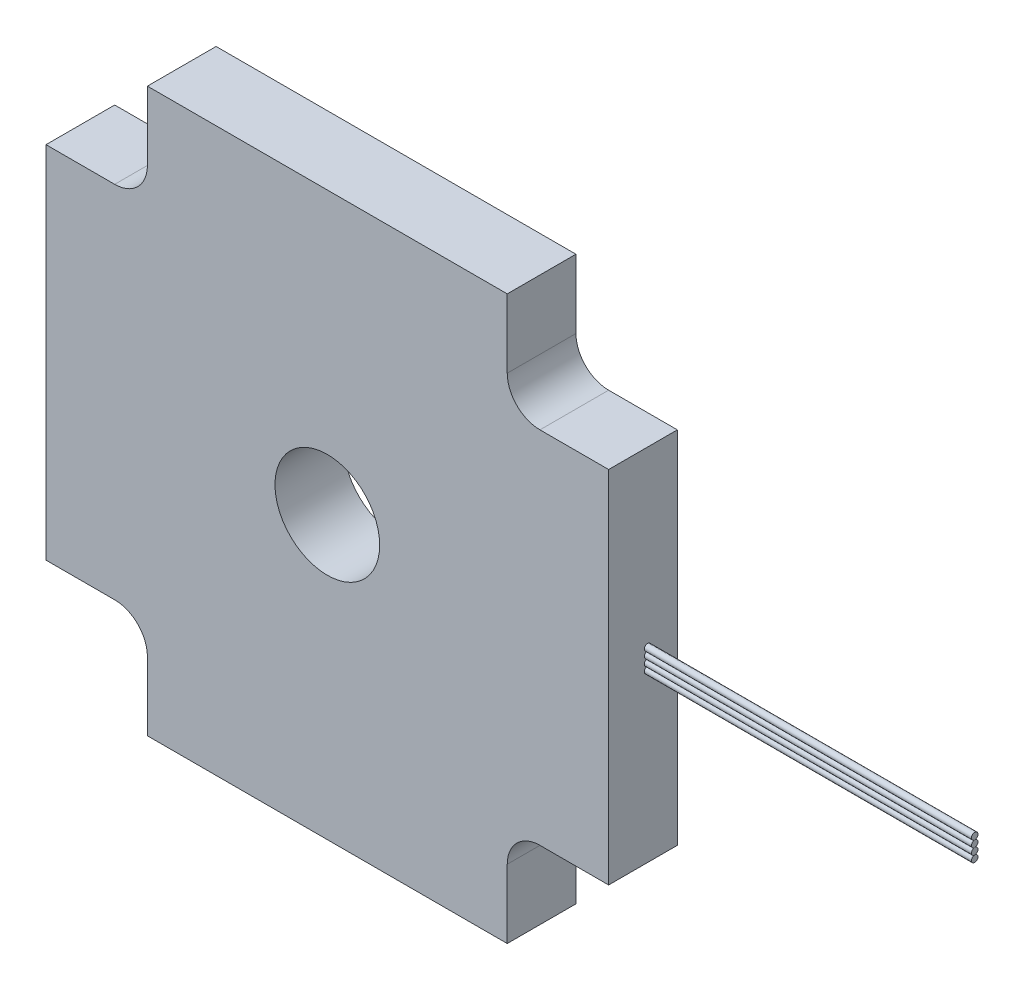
ISO-10303-21;
HEADER;
FILE_DESCRIPTION(('STEP AP214'),'2;1');
FILE_NAME('part.step','',(''),(''),'','','');
FILE_SCHEMA(('AUTOMOTIVE_DESIGN { 1 0 10303 214 1 1 1 1 }'));
ENDSEC;
DATA;
#1=APPLICATION_CONTEXT('core data for automotive mechanical design processes');
#2=APPLICATION_PROTOCOL_DEFINITION('international standard','automotive_design',2000,#1);
#3=PRODUCT_CONTEXT('',#1,'mechanical');
#4=PRODUCT('Part','Part','',(#3));
#5=PRODUCT_RELATED_PRODUCT_CATEGORY('part','',(#4));
#6=PRODUCT_DEFINITION_FORMATION('','',#4);
#7=PRODUCT_DEFINITION_CONTEXT('part definition',#1,'design');
#8=PRODUCT_DEFINITION('design','',#6,#7);
#9=PRODUCT_DEFINITION_SHAPE('','',#8);
#10=(LENGTH_UNIT() NAMED_UNIT(*) SI_UNIT(.MILLI.,.METRE.));
#11=(NAMED_UNIT(*) PLANE_ANGLE_UNIT() SI_UNIT($,.RADIAN.));
#12=(NAMED_UNIT(*) SI_UNIT($,.STERADIAN.) SOLID_ANGLE_UNIT());
#13=UNCERTAINTY_MEASURE_WITH_UNIT(LENGTH_MEASURE(1.E-05),#10,'distance_accuracy_value','');
#14=(GEOMETRIC_REPRESENTATION_CONTEXT(3) GLOBAL_UNCERTAINTY_ASSIGNED_CONTEXT((#13)) GLOBAL_UNIT_ASSIGNED_CONTEXT((#10,
#11,#12)) REPRESENTATION_CONTEXT('',''));
#15=CARTESIAN_POINT('',(0.,0.,0.));
#16=DIRECTION('',(0.,0.,1.));
#17=DIRECTION('',(1.,0.,0.));
#18=AXIS2_PLACEMENT_3D('',#15,#16,#17);
#19=CARTESIAN_POINT('',(93.,-2.,4.54479734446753));
#20=DIRECTION('',(-1.,0.,0.));
#21=DIRECTION('',(0.,0.,1.));
#22=AXIS2_PLACEMENT_3D('',#19,#20,#21);
#23=CYLINDRICAL_SURFACE('',#22,0.500000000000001);
#24=CARTESIAN_POINT('',(43.,-2.,4.54479734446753));
#25=DIRECTION('',(1.,0.,0.));
#26=DIRECTION('',(0.,0.,-1.));
#27=AXIS2_PLACEMENT_3D('',#24,#25,#26);
#28=CIRCLE('',#27,0.500000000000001);
#29=CARTESIAN_POINT('',(43.,-2.,4.04479734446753));
#30=VERTEX_POINT('',#29);
#31=EDGE_CURVE('E12',#30,#30,#28,.T.);
#32=ORIENTED_EDGE('',*,*,#31,.T.);
#33=EDGE_LOOP('',(#32));
#34=FACE_BOUND('',#33,.T.);
#35=CARTESIAN_POINT('',(93.,-2.,4.54479734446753));
#36=DIRECTION('',(1.,0.,0.));
#37=DIRECTION('',(0.,0.,-1.));
#38=AXIS2_PLACEMENT_3D('',#35,#36,#37);
#39=CIRCLE('',#38,0.500000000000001);
#40=CARTESIAN_POINT('',(93.,-2.,4.04479734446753));
#41=VERTEX_POINT('',#40);
#42=EDGE_CURVE('E56',#41,#41,#39,.T.);
#43=ORIENTED_EDGE('',*,*,#42,.F.);
#44=EDGE_LOOP('',(#43));
#45=FACE_BOUND('',#44,.T.);
#46=ADVANCED_FACE('F52',(#34,#45),#23,.T.);
#47=CARTESIAN_POINT('',(93.,-2.,4.54479734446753));
#48=DIRECTION('',(1.,0.,0.));
#49=DIRECTION('',(0.,0.,-1.));
#50=AXIS2_PLACEMENT_3D('',#47,#48,#49);
#51=PLANE('',#50);
#52=ORIENTED_EDGE('',*,*,#42,.T.);
#53=EDGE_LOOP('',(#52));
#54=FACE_BOUND('',#53,.T.);
#55=ADVANCED_FACE('F54',(#54),#51,.T.);
#56=CARTESIAN_POINT('',(43.,-2.,4.54479734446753));
#57=DIRECTION('',(1.,0.,0.));
#58=DIRECTION('',(0.,0.,-1.));
#59=AXIS2_PLACEMENT_3D('',#56,#57,#58);
#60=PLANE('',#59);
#61=ORIENTED_EDGE('',*,*,#31,.F.);
#62=EDGE_LOOP('',(#61));
#63=FACE_BOUND('',#62,.T.);
#64=ADVANCED_FACE('F71',(#63),#60,.F.);
#65=CLOSED_SHELL('',(#46,#55,#64));
#66=MANIFOLD_SOLID_BREP('B2',#65);
#67=CARTESIAN_POINT('',(93.,0.,4.54479734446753));
#68=DIRECTION('',(-1.,0.,0.));
#69=DIRECTION('',(0.,0.,1.));
#70=AXIS2_PLACEMENT_3D('',#67,#68,#69);
#71=CYLINDRICAL_SURFACE('',#70,0.500000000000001);
#72=CARTESIAN_POINT('',(43.,0.,4.54479734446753));
#73=DIRECTION('',(1.,0.,0.));
#74=DIRECTION('',(0.,0.,-1.));
#75=AXIS2_PLACEMENT_3D('',#72,#73,#74);
#76=CIRCLE('',#75,0.500000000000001);
#77=CARTESIAN_POINT('',(43.,0.,4.04479734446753));
#78=VERTEX_POINT('',#77);
#79=EDGE_CURVE('E51',#78,#78,#76,.T.);
#80=ORIENTED_EDGE('',*,*,#79,.T.);
#81=EDGE_LOOP('',(#80));
#82=FACE_BOUND('',#81,.T.);
#83=CARTESIAN_POINT('',(93.,0.,4.54479734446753));
#84=DIRECTION('',(1.,0.,0.));
#85=DIRECTION('',(0.,0.,-1.));
#86=AXIS2_PLACEMENT_3D('',#83,#84,#85);
#87=CIRCLE('',#86,0.500000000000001);
#88=CARTESIAN_POINT('',(93.,0.,4.04479734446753));
#89=VERTEX_POINT('',#88);
#90=EDGE_CURVE('E105',#89,#89,#87,.T.);
#91=ORIENTED_EDGE('',*,*,#90,.F.);
#92=EDGE_LOOP('',(#91));
#93=FACE_BOUND('',#92,.T.);
#94=ADVANCED_FACE('F101',(#82,#93),#71,.T.);
#95=CARTESIAN_POINT('',(93.,0.,4.54479734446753));
#96=DIRECTION('',(1.,0.,0.));
#97=DIRECTION('',(0.,0.,-1.));
#98=AXIS2_PLACEMENT_3D('',#95,#96,#97);
#99=PLANE('',#98);
#100=ORIENTED_EDGE('',*,*,#90,.T.);
#101=EDGE_LOOP('',(#100));
#102=FACE_BOUND('',#101,.T.);
#103=ADVANCED_FACE('F103',(#102),#99,.T.);
#104=CARTESIAN_POINT('',(43.,0.,4.54479734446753));
#105=DIRECTION('',(1.,0.,0.));
#106=DIRECTION('',(0.,0.,-1.));
#107=AXIS2_PLACEMENT_3D('',#104,#105,#106);
#108=PLANE('',#107);
#109=ORIENTED_EDGE('',*,*,#79,.F.);
#110=EDGE_LOOP('',(#109));
#111=FACE_BOUND('',#110,.T.);
#112=ADVANCED_FACE('F120',(#111),#108,.F.);
#113=CLOSED_SHELL('',(#94,#103,#112));
#114=MANIFOLD_SOLID_BREP('B7',#113);
#115=CARTESIAN_POINT('',(93.,1.,4.54479734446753));
#116=DIRECTION('',(-1.,0.,0.));
#117=DIRECTION('',(0.,0.,1.));
#118=AXIS2_PLACEMENT_3D('',#115,#116,#117);
#119=CYLINDRICAL_SURFACE('',#118,0.500000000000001);
#120=CARTESIAN_POINT('',(43.,1.,4.54479734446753));
#121=DIRECTION('',(1.,0.,0.));
#122=DIRECTION('',(0.,0.,-1.));
#123=AXIS2_PLACEMENT_3D('',#120,#121,#122);
#124=CIRCLE('',#123,0.500000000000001);
#125=CARTESIAN_POINT('',(43.,1.,4.04479734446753));
#126=VERTEX_POINT('',#125);
#127=EDGE_CURVE('E100',#126,#126,#124,.T.);
#128=ORIENTED_EDGE('',*,*,#127,.T.);
#129=EDGE_LOOP('',(#128));
#130=FACE_BOUND('',#129,.T.);
#131=CARTESIAN_POINT('',(93.,1.,4.54479734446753));
#132=DIRECTION('',(1.,0.,0.));
#133=DIRECTION('',(0.,0.,-1.));
#134=AXIS2_PLACEMENT_3D('',#131,#132,#133);
#135=CIRCLE('',#134,0.500000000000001);
#136=CARTESIAN_POINT('',(93.,1.,4.04479734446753));
#137=VERTEX_POINT('',#136);
#138=EDGE_CURVE('E154',#137,#137,#135,.T.);
#139=ORIENTED_EDGE('',*,*,#138,.F.);
#140=EDGE_LOOP('',(#139));
#141=FACE_BOUND('',#140,.T.);
#142=ADVANCED_FACE('F150',(#130,#141),#119,.T.);
#143=CARTESIAN_POINT('',(93.,1.,4.54479734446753));
#144=DIRECTION('',(1.,0.,0.));
#145=DIRECTION('',(0.,0.,-1.));
#146=AXIS2_PLACEMENT_3D('',#143,#144,#145);
#147=PLANE('',#146);
#148=ORIENTED_EDGE('',*,*,#138,.T.);
#149=EDGE_LOOP('',(#148));
#150=FACE_BOUND('',#149,.T.);
#151=ADVANCED_FACE('F152',(#150),#147,.T.);
#152=CARTESIAN_POINT('',(43.,1.,4.54479734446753));
#153=DIRECTION('',(1.,0.,0.));
#154=DIRECTION('',(0.,0.,-1.));
#155=AXIS2_PLACEMENT_3D('',#152,#153,#154);
#156=PLANE('',#155);
#157=ORIENTED_EDGE('',*,*,#127,.F.);
#158=EDGE_LOOP('',(#157));
#159=FACE_BOUND('',#158,.T.);
#160=ADVANCED_FACE('F169',(#159),#156,.F.);
#161=CLOSED_SHELL('',(#142,#151,#160));
#162=MANIFOLD_SOLID_BREP('B46',#161);
#163=CARTESIAN_POINT('',(93.,-1.,4.54479734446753));
#164=DIRECTION('',(-1.,0.,0.));
#165=DIRECTION('',(0.,0.,1.));
#166=AXIS2_PLACEMENT_3D('',#163,#164,#165);
#167=CYLINDRICAL_SURFACE('',#166,0.500000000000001);
#168=CARTESIAN_POINT('',(43.,-1.,4.54479734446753));
#169=DIRECTION('',(1.,0.,0.));
#170=DIRECTION('',(0.,0.,-1.));
#171=AXIS2_PLACEMENT_3D('',#168,#169,#170);
#172=CIRCLE('',#171,0.500000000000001);
#173=CARTESIAN_POINT('',(43.,-1.,4.04479734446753));
#174=VERTEX_POINT('',#173);
#175=EDGE_CURVE('E203',#174,#174,#172,.T.);
#176=ORIENTED_EDGE('',*,*,#175,.T.);
#177=EDGE_LOOP('',(#176));
#178=FACE_BOUND('',#177,.T.);
#179=CARTESIAN_POINT('',(93.,-1.,4.54479734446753));
#180=DIRECTION('',(1.,0.,0.));
#181=DIRECTION('',(0.,0.,-1.));
#182=AXIS2_PLACEMENT_3D('',#179,#180,#181);
#183=CIRCLE('',#182,0.500000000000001);
#184=CARTESIAN_POINT('',(93.,-1.,4.04479734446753));
#185=VERTEX_POINT('',#184);
#186=EDGE_CURVE('E149',#185,#185,#183,.T.);
#187=ORIENTED_EDGE('',*,*,#186,.F.);
#188=EDGE_LOOP('',(#187));
#189=FACE_BOUND('',#188,.T.);
#190=ADVANCED_FACE('F200',(#178,#189),#167,.T.);
#191=CARTESIAN_POINT('',(93.,-1.,4.54479734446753));
#192=DIRECTION('',(1.,0.,0.));
#193=DIRECTION('',(0.,0.,-1.));
#194=AXIS2_PLACEMENT_3D('',#191,#192,#193);
#195=PLANE('',#194);
#196=ORIENTED_EDGE('',*,*,#186,.T.);
#197=EDGE_LOOP('',(#196));
#198=FACE_BOUND('',#197,.T.);
#199=ADVANCED_FACE('F216',(#198),#195,.T.);
#200=CARTESIAN_POINT('',(43.,-1.,4.54479734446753));
#201=DIRECTION('',(1.,0.,0.));
#202=DIRECTION('',(0.,0.,-1.));
#203=AXIS2_PLACEMENT_3D('',#200,#201,#202);
#204=PLANE('',#203);
#205=ORIENTED_EDGE('',*,*,#175,.F.);
#206=EDGE_LOOP('',(#205));
#207=FACE_BOUND('',#206,.T.);
#208=ADVANCED_FACE('F214',(#207),#204,.F.);
#209=CLOSED_SHELL('',(#190,#199,#208));
#210=MANIFOLD_SOLID_BREP('B95',#209);
#211=CARTESIAN_POINT('',(32.5,-32.5,10.5));
#212=DIRECTION('',(0.,0.,1.));
#213=DIRECTION('',(1.,0.,0.));
#214=AXIS2_PLACEMENT_3D('',#211,#212,#213);
#215=CYLINDRICAL_SURFACE('',#214,5.);
#216=DIRECTION('',(0.,0.,-1.));
#217=VECTOR('',#216,1.);
#218=CARTESIAN_POINT('',(32.5,-27.5,10.5));
#219=LINE('',#218,#217);
#220=CARTESIAN_POINT('',(32.5,-27.5,10.5));
#221=VERTEX_POINT('',#220);
#222=CARTESIAN_POINT('',(32.5,-27.5,0.));
#223=VERTEX_POINT('',#222);
#224=EDGE_CURVE('E404',#221,#223,#219,.T.);
#225=ORIENTED_EDGE('',*,*,#224,.F.);
#226=CARTESIAN_POINT('',(32.5,-32.5,10.5));
#227=DIRECTION('',(0.,0.,1.));
#228=DIRECTION('',(1.,0.,0.));
#229=AXIS2_PLACEMENT_3D('',#226,#227,#228);
#230=CIRCLE('',#229,5.);
#231=CARTESIAN_POINT('',(27.5,-32.5,10.5));
#232=VERTEX_POINT('',#231);
#233=EDGE_CURVE('E410',#221,#232,#230,.T.);
#234=ORIENTED_EDGE('',*,*,#233,.T.);
#235=DIRECTION('',(0.,0.,-1.));
#236=VECTOR('',#235,1.);
#237=CARTESIAN_POINT('',(27.5,-32.5,10.5));
#238=LINE('',#237,#236);
#239=CARTESIAN_POINT('',(27.5,-32.5,0.));
#240=VERTEX_POINT('',#239);
#241=EDGE_CURVE('E407',#240,#232,#238,.F.);
#242=ORIENTED_EDGE('',*,*,#241,.F.);
#243=CARTESIAN_POINT('',(32.5,-32.5,0.));
#244=DIRECTION('',(0.,0.,1.));
#245=DIRECTION('',(1.,0.,0.));
#246=AXIS2_PLACEMENT_3D('',#243,#244,#245);
#247=CIRCLE('',#246,5.);
#248=EDGE_CURVE('E412',#240,#223,#247,.F.);
#249=ORIENTED_EDGE('',*,*,#248,.T.);
#250=EDGE_LOOP('',(#225,#234,#242,#249));
#251=FACE_BOUND('',#250,.T.);
#252=ADVANCED_FACE('F241',(#251),#215,.F.);
#253=CARTESIAN_POINT('',(32.5,32.5,10.5));
#254=DIRECTION('',(0.,0.,1.));
#255=DIRECTION('',(1.,0.,0.));
#256=AXIS2_PLACEMENT_3D('',#253,#254,#255);
#257=CYLINDRICAL_SURFACE('',#256,5.);
#258=DIRECTION('',(0.,0.,-1.));
#259=VECTOR('',#258,1.);
#260=CARTESIAN_POINT('',(27.5,32.5,10.5));
#261=LINE('',#260,#259);
#262=CARTESIAN_POINT('',(27.5,32.5,10.5));
#263=VERTEX_POINT('',#262);
#264=CARTESIAN_POINT('',(27.5,32.5,0.));
#265=VERTEX_POINT('',#264);
#266=EDGE_CURVE('E394',#263,#265,#261,.T.);
#267=ORIENTED_EDGE('',*,*,#266,.F.);
#268=CARTESIAN_POINT('',(32.5,32.5,10.5));
#269=DIRECTION('',(0.,0.,1.));
#270=DIRECTION('',(1.,0.,0.));
#271=AXIS2_PLACEMENT_3D('',#268,#269,#270);
#272=CIRCLE('',#271,5.);
#273=CARTESIAN_POINT('',(32.5,27.5,10.5));
#274=VERTEX_POINT('',#273);
#275=EDGE_CURVE('E400',#263,#274,#272,.T.);
#276=ORIENTED_EDGE('',*,*,#275,.T.);
#277=DIRECTION('',(0.,0.,-1.));
#278=VECTOR('',#277,1.);
#279=CARTESIAN_POINT('',(32.5,27.5,10.5));
#280=LINE('',#279,#278);
#281=CARTESIAN_POINT('',(32.5,27.5,0.));
#282=VERTEX_POINT('',#281);
#283=EDGE_CURVE('E397',#282,#274,#280,.F.);
#284=ORIENTED_EDGE('',*,*,#283,.F.);
#285=CARTESIAN_POINT('',(32.5,32.5,0.));
#286=DIRECTION('',(0.,0.,1.));
#287=DIRECTION('',(1.,0.,0.));
#288=AXIS2_PLACEMENT_3D('',#285,#286,#287);
#289=CIRCLE('',#288,5.);
#290=EDGE_CURVE('E402',#282,#265,#289,.F.);
#291=ORIENTED_EDGE('',*,*,#290,.T.);
#292=EDGE_LOOP('',(#267,#276,#284,#291));
#293=FACE_BOUND('',#292,.T.);
#294=ADVANCED_FACE('F509',(#293),#257,.F.);
#295=CARTESIAN_POINT('',(-32.5,32.5,10.5));
#296=DIRECTION('',(0.,0.,-1.));
#297=DIRECTION('',(-1.,0.,0.));
#298=AXIS2_PLACEMENT_3D('',#295,#296,#297);
#299=CYLINDRICAL_SURFACE('',#298,5.);
#300=DIRECTION('',(0.,0.,1.));
#301=VECTOR('',#300,1.);
#302=CARTESIAN_POINT('',(-27.5,32.5,10.5));
#303=LINE('',#302,#301);
#304=CARTESIAN_POINT('',(-27.5,32.5,0.));
#305=VERTEX_POINT('',#304);
#306=CARTESIAN_POINT('',(-27.5,32.5,10.5));
#307=VERTEX_POINT('',#306);
#308=EDGE_CURVE('E379',#305,#307,#303,.T.);
#309=ORIENTED_EDGE('',*,*,#308,.F.);
#310=CARTESIAN_POINT('',(-32.5,32.5,0.));
#311=DIRECTION('',(0.,0.,1.));
#312=DIRECTION('',(1.,0.,0.));
#313=AXIS2_PLACEMENT_3D('',#310,#311,#312);
#314=CIRCLE('',#313,5.);
#315=CARTESIAN_POINT('',(-32.5,27.5,0.));
#316=VERTEX_POINT('',#315);
#317=EDGE_CURVE('E390',#305,#316,#314,.F.);
#318=ORIENTED_EDGE('',*,*,#317,.T.);
#319=DIRECTION('',(0.,0.,1.));
#320=VECTOR('',#319,1.);
#321=CARTESIAN_POINT('',(-32.5,27.5,10.5));
#322=LINE('',#321,#320);
#323=CARTESIAN_POINT('',(-32.5,27.5,10.5));
#324=VERTEX_POINT('',#323);
#325=EDGE_CURVE('E382',#324,#316,#322,.F.);
#326=ORIENTED_EDGE('',*,*,#325,.F.);
#327=CARTESIAN_POINT('',(-32.5,32.5,10.5));
#328=DIRECTION('',(0.,0.,1.));
#329=DIRECTION('',(1.,0.,0.));
#330=AXIS2_PLACEMENT_3D('',#327,#328,#329);
#331=CIRCLE('',#330,5.);
#332=EDGE_CURVE('E392',#324,#307,#331,.T.);
#333=ORIENTED_EDGE('',*,*,#332,.T.);
#334=EDGE_LOOP('',(#309,#318,#326,#333));
#335=FACE_BOUND('',#334,.T.);
#336=ADVANCED_FACE('F514',(#335),#299,.F.);
#337=CARTESIAN_POINT('',(-27.5,-43.,10.5));
#338=DIRECTION('',(1.,0.,0.));
#339=DIRECTION('',(0.,1.,0.));
#340=AXIS2_PLACEMENT_3D('',#337,#338,#339);
#341=PLANE('',#340);
#342=DIRECTION('',(0.,-1.,0.));
#343=VECTOR('',#342,1.);
#344=CARTESIAN_POINT('',(-27.5,-43.,10.5));
#345=LINE('',#344,#343);
#346=CARTESIAN_POINT('',(-27.5,-32.5,10.5));
#347=VERTEX_POINT('',#346);
#348=CARTESIAN_POINT('',(-27.5,-43.,10.5));
#349=VERTEX_POINT('',#348);
#350=EDGE_CURVE('E353',#347,#349,#345,.T.);
#351=ORIENTED_EDGE('',*,*,#350,.F.);
#352=DIRECTION('',(0.,0.,-1.));
#353=VECTOR('',#352,1.);
#354=CARTESIAN_POINT('',(-27.5,-32.5,0.));
#355=LINE('',#354,#353);
#356=CARTESIAN_POINT('',(-27.5,-32.5,0.));
#357=VERTEX_POINT('',#356);
#358=EDGE_CURVE('E414',#347,#357,#355,.T.);
#359=ORIENTED_EDGE('',*,*,#358,.T.);
#360=DIRECTION('',(0.,-1.,0.));
#361=VECTOR('',#360,1.);
#362=CARTESIAN_POINT('',(-27.5,-43.,0.));
#363=LINE('',#362,#361);
#364=CARTESIAN_POINT('',(-27.5,-43.,0.));
#365=VERTEX_POINT('',#364);
#366=EDGE_CURVE('E377',#357,#365,#363,.T.);
#367=ORIENTED_EDGE('',*,*,#366,.T.);
#368=DIRECTION('',(0.,0.,-1.));
#369=VECTOR('',#368,1.);
#370=CARTESIAN_POINT('',(-27.5,-43.,10.5));
#371=LINE('',#370,#369);
#372=EDGE_CURVE('E370',#349,#365,#371,.T.);
#373=ORIENTED_EDGE('',*,*,#372,.F.);
#374=EDGE_LOOP('',(#351,#359,#367,#373));
#375=FACE_BOUND('',#374,.T.);
#376=ADVANCED_FACE('F376',(#375),#341,.F.);
#377=CARTESIAN_POINT('',(27.5,-43.,10.5));
#378=DIRECTION('',(0.,1.,0.));
#379=DIRECTION('',(0.,0.,1.));
#380=AXIS2_PLACEMENT_3D('',#377,#378,#379);
#381=PLANE('',#380);
#382=DIRECTION('',(1.,0.,0.));
#383=VECTOR('',#382,1.);
#384=CARTESIAN_POINT('',(27.5,-43.,0.));
#385=LINE('',#384,#383);
#386=CARTESIAN_POINT('',(27.5,-43.,0.));
#387=VERTEX_POINT('',#386);
#388=EDGE_CURVE('E419',#365,#387,#385,.T.);
#389=ORIENTED_EDGE('',*,*,#388,.T.);
#390=DIRECTION('',(0.,0.,-1.));
#391=VECTOR('',#390,1.);
#392=CARTESIAN_POINT('',(27.5,-43.,10.5));
#393=LINE('',#392,#391);
#394=CARTESIAN_POINT('',(27.5,-43.,10.5));
#395=VERTEX_POINT('',#394);
#396=EDGE_CURVE('E372',#395,#387,#393,.T.);
#397=ORIENTED_EDGE('',*,*,#396,.F.);
#398=DIRECTION('',(1.,0.,0.));
#399=VECTOR('',#398,1.);
#400=CARTESIAN_POINT('',(27.5,-43.,10.5));
#401=LINE('',#400,#399);
#402=EDGE_CURVE('E358',#349,#395,#401,.T.);
#403=ORIENTED_EDGE('',*,*,#402,.F.);
#404=ORIENTED_EDGE('',*,*,#372,.T.);
#405=EDGE_LOOP('',(#389,#397,#403,#404));
#406=FACE_BOUND('',#405,.T.);
#407=ADVANCED_FACE('F369',(#406),#381,.F.);
#408=CARTESIAN_POINT('',(27.5,-43.,10.5));
#409=DIRECTION('',(-1.,0.,0.));
#410=DIRECTION('',(0.,0.,1.));
#411=AXIS2_PLACEMENT_3D('',#408,#409,#410);
#412=PLANE('',#411);
#413=DIRECTION('',(0.,1.,0.));
#414=VECTOR('',#413,1.);
#415=CARTESIAN_POINT('',(27.5,-43.,0.));
#416=LINE('',#415,#414);
#417=EDGE_CURVE('E422',#387,#240,#416,.T.);
#418=ORIENTED_EDGE('',*,*,#417,.T.);
#419=ORIENTED_EDGE('',*,*,#241,.T.);
#420=DIRECTION('',(0.,1.,0.));
#421=VECTOR('',#420,1.);
#422=CARTESIAN_POINT('',(27.5,-43.,10.5));
#423=LINE('',#422,#421);
#424=EDGE_CURVE('E374',#395,#232,#423,.T.);
#425=ORIENTED_EDGE('',*,*,#424,.F.);
#426=ORIENTED_EDGE('',*,*,#396,.T.);
#427=EDGE_LOOP('',(#418,#419,#425,#426));
#428=FACE_BOUND('',#427,.T.);
#429=ADVANCED_FACE('F526',(#428),#412,.F.);
#430=CARTESIAN_POINT('',(43.,-27.5,10.5));
#431=DIRECTION('',(0.,1.,0.));
#432=DIRECTION('',(0.,0.,1.));
#433=AXIS2_PLACEMENT_3D('',#430,#431,#432);
#434=PLANE('',#433);
#435=DIRECTION('',(1.,0.,0.));
#436=VECTOR('',#435,1.);
#437=CARTESIAN_POINT('',(43.,-27.5,10.5));
#438=LINE('',#437,#436);
#439=CARTESIAN_POINT('',(43.,-27.5,10.5));
#440=VERTEX_POINT('',#439);
#441=EDGE_CURVE('E489',#221,#440,#438,.T.);
#442=ORIENTED_EDGE('',*,*,#441,.F.);
#443=ORIENTED_EDGE('',*,*,#224,.T.);
#444=DIRECTION('',(1.,0.,0.));
#445=VECTOR('',#444,1.);
#446=CARTESIAN_POINT('',(43.,-27.5,0.));
#447=LINE('',#446,#445);
#448=CARTESIAN_POINT('',(43.,-27.5,0.));
#449=VERTEX_POINT('',#448);
#450=EDGE_CURVE('E433',#223,#449,#447,.T.);
#451=ORIENTED_EDGE('',*,*,#450,.T.);
#452=DIRECTION('',(0.,0.,-1.));
#453=VECTOR('',#452,1.);
#454=CARTESIAN_POINT('',(43.,-27.5,10.5));
#455=LINE('',#454,#453);
#456=EDGE_CURVE('E384',#440,#449,#455,.T.);
#457=ORIENTED_EDGE('',*,*,#456,.F.);
#458=EDGE_LOOP('',(#442,#443,#451,#457));
#459=FACE_BOUND('',#458,.T.);
#460=ADVANCED_FACE('F529',(#459),#434,.F.);
#461=CARTESIAN_POINT('',(43.,-27.5,10.5));
#462=DIRECTION('',(-1.,0.,0.));
#463=DIRECTION('',(0.,0.,1.));
#464=AXIS2_PLACEMENT_3D('',#461,#462,#463);
#465=PLANE('',#464);
#466=DIRECTION('',(0.,1.,0.));
#467=VECTOR('',#466,1.);
#468=CARTESIAN_POINT('',(43.,-27.5,0.));
#469=LINE('',#468,#467);
#470=CARTESIAN_POINT('',(43.,27.5,0.));
#471=VERTEX_POINT('',#470);
#472=EDGE_CURVE('E435',#449,#471,#469,.T.);
#473=ORIENTED_EDGE('',*,*,#472,.T.);
#474=DIRECTION('',(0.,0.,-1.));
#475=VECTOR('',#474,1.);
#476=CARTESIAN_POINT('',(43.,27.5,10.5));
#477=LINE('',#476,#475);
#478=CARTESIAN_POINT('',(43.,27.5,10.5));
#479=VERTEX_POINT('',#478);
#480=EDGE_CURVE('E464',#479,#471,#477,.T.);
#481=ORIENTED_EDGE('',*,*,#480,.F.);
#482=DIRECTION('',(0.,1.,0.));
#483=VECTOR('',#482,1.);
#484=CARTESIAN_POINT('',(43.,-27.5,10.5));
#485=LINE('',#484,#483);
#486=EDGE_CURVE('E473',#440,#479,#485,.T.);
#487=ORIENTED_EDGE('',*,*,#486,.F.);
#488=ORIENTED_EDGE('',*,*,#456,.T.);
#489=EDGE_LOOP('',(#473,#481,#487,#488));
#490=FACE_BOUND('',#489,.T.);
#491=ADVANCED_FACE('F471',(#490),#465,.F.);
#492=CARTESIAN_POINT('',(43.,27.5,10.5));
#493=DIRECTION('',(0.,-1.,0.));
#494=DIRECTION('',(0.,0.,-1.));
#495=AXIS2_PLACEMENT_3D('',#492,#493,#494);
#496=PLANE('',#495);
#497=DIRECTION('',(-1.,0.,0.));
#498=VECTOR('',#497,1.);
#499=CARTESIAN_POINT('',(43.,27.5,0.));
#500=LINE('',#499,#498);
#501=EDGE_CURVE('E437',#471,#282,#500,.T.);
#502=ORIENTED_EDGE('',*,*,#501,.T.);
#503=ORIENTED_EDGE('',*,*,#283,.T.);
#504=DIRECTION('',(-1.,0.,0.));
#505=VECTOR('',#504,1.);
#506=CARTESIAN_POINT('',(43.,27.5,10.5));
#507=LINE('',#506,#505);
#508=EDGE_CURVE('E484',#479,#274,#507,.T.);
#509=ORIENTED_EDGE('',*,*,#508,.F.);
#510=ORIENTED_EDGE('',*,*,#480,.T.);
#511=EDGE_LOOP('',(#502,#503,#509,#510));
#512=FACE_BOUND('',#511,.T.);
#513=ADVANCED_FACE('F481',(#512),#496,.F.);
#514=CARTESIAN_POINT('',(27.5,27.5,10.5));
#515=DIRECTION('',(-1.,0.,0.));
#516=DIRECTION('',(0.,0.,1.));
#517=AXIS2_PLACEMENT_3D('',#514,#515,#516);
#518=PLANE('',#517);
#519=DIRECTION('',(0.,1.,0.));
#520=VECTOR('',#519,1.);
#521=CARTESIAN_POINT('',(27.5,27.5,10.5));
#522=LINE('',#521,#520);
#523=CARTESIAN_POINT('',(27.5,43.,10.5));
#524=VERTEX_POINT('',#523);
#525=EDGE_CURVE('E485',#263,#524,#522,.T.);
#526=ORIENTED_EDGE('',*,*,#525,.F.);
#527=ORIENTED_EDGE('',*,*,#266,.T.);
#528=DIRECTION('',(0.,1.,0.));
#529=VECTOR('',#528,1.);
#530=CARTESIAN_POINT('',(27.5,27.5,0.));
#531=LINE('',#530,#529);
#532=CARTESIAN_POINT('',(27.5,43.,0.));
#533=VERTEX_POINT('',#532);
#534=EDGE_CURVE('E440',#265,#533,#531,.T.);
#535=ORIENTED_EDGE('',*,*,#534,.T.);
#536=DIRECTION('',(0.,0.,-1.));
#537=VECTOR('',#536,1.);
#538=CARTESIAN_POINT('',(27.5,43.,10.5));
#539=LINE('',#538,#537);
#540=EDGE_CURVE('E461',#524,#533,#539,.T.);
#541=ORIENTED_EDGE('',*,*,#540,.F.);
#542=EDGE_LOOP('',(#526,#527,#535,#541));
#543=FACE_BOUND('',#542,.T.);
#544=ADVANCED_FACE('F537',(#543),#518,.F.);
#545=CARTESIAN_POINT('',(27.5,43.,10.5));
#546=DIRECTION('',(0.,-1.,0.));
#547=DIRECTION('',(0.,0.,-1.));
#548=AXIS2_PLACEMENT_3D('',#545,#546,#547);
#549=PLANE('',#548);
#550=DIRECTION('',(-1.,0.,0.));
#551=VECTOR('',#550,1.);
#552=CARTESIAN_POINT('',(27.5,43.,0.));
#553=LINE('',#552,#551);
#554=CARTESIAN_POINT('',(-27.5,43.,0.));
#555=VERTEX_POINT('',#554);
#556=EDGE_CURVE('E442',#533,#555,#553,.T.);
#557=ORIENTED_EDGE('',*,*,#556,.T.);
#558=DIRECTION('',(0.,0.,-1.));
#559=VECTOR('',#558,1.);
#560=CARTESIAN_POINT('',(-27.5,43.,10.5));
#561=LINE('',#560,#559);
#562=CARTESIAN_POINT('',(-27.5,43.,10.5));
#563=VERTEX_POINT('',#562);
#564=EDGE_CURVE('E458',#563,#555,#561,.T.);
#565=ORIENTED_EDGE('',*,*,#564,.F.);
#566=DIRECTION('',(-1.,0.,0.));
#567=VECTOR('',#566,1.);
#568=CARTESIAN_POINT('',(27.5,43.,10.5));
#569=LINE('',#568,#567);
#570=EDGE_CURVE('E487',#524,#563,#569,.T.);
#571=ORIENTED_EDGE('',*,*,#570,.F.);
#572=ORIENTED_EDGE('',*,*,#540,.T.);
#573=EDGE_LOOP('',(#557,#565,#571,#572));
#574=FACE_BOUND('',#573,.T.);
#575=ADVANCED_FACE('F540',(#574),#549,.F.);
#576=CARTESIAN_POINT('',(-27.5,27.5,10.5));
#577=DIRECTION('',(1.,0.,0.));
#578=DIRECTION('',(0.,1.,0.));
#579=AXIS2_PLACEMENT_3D('',#576,#577,#578);
#580=PLANE('',#579);
#581=DIRECTION('',(0.,-1.,0.));
#582=VECTOR('',#581,1.);
#583=CARTESIAN_POINT('',(-27.5,27.5,0.));
#584=LINE('',#583,#582);
#585=EDGE_CURVE('E444',#555,#305,#584,.T.);
#586=ORIENTED_EDGE('',*,*,#585,.T.);
#587=ORIENTED_EDGE('',*,*,#308,.T.);
#588=DIRECTION('',(0.,-1.,0.));
#589=VECTOR('',#588,1.);
#590=CARTESIAN_POINT('',(-27.5,27.5,10.5));
#591=LINE('',#590,#589);
#592=EDGE_CURVE('E494',#563,#307,#591,.T.);
#593=ORIENTED_EDGE('',*,*,#592,.F.);
#594=ORIENTED_EDGE('',*,*,#564,.T.);
#595=EDGE_LOOP('',(#586,#587,#593,#594));
#596=FACE_BOUND('',#595,.T.);
#597=ADVANCED_FACE('F544',(#596),#580,.F.);
#598=CARTESIAN_POINT('',(-27.5,27.5,10.5));
#599=DIRECTION('',(0.,-1.,0.));
#600=DIRECTION('',(1.,0.,0.));
#601=AXIS2_PLACEMENT_3D('',#598,#599,#600);
#602=PLANE('',#601);
#603=DIRECTION('',(-1.,0.,0.));
#604=VECTOR('',#603,1.);
#605=CARTESIAN_POINT('',(-27.5,27.5,10.5));
#606=LINE('',#605,#604);
#607=CARTESIAN_POINT('',(-43.,27.5,10.5));
#608=VERTEX_POINT('',#607);
#609=EDGE_CURVE('E497',#324,#608,#606,.T.);
#610=ORIENTED_EDGE('',*,*,#609,.F.);
#611=ORIENTED_EDGE('',*,*,#325,.T.);
#612=DIRECTION('',(-1.,0.,0.));
#613=VECTOR('',#612,1.);
#614=CARTESIAN_POINT('',(-27.5,27.5,0.));
#615=LINE('',#614,#613);
#616=CARTESIAN_POINT('',(-43.,27.5,0.));
#617=VERTEX_POINT('',#616);
#618=EDGE_CURVE('E447',#316,#617,#615,.T.);
#619=ORIENTED_EDGE('',*,*,#618,.T.);
#620=DIRECTION('',(0.,0.,-1.));
#621=VECTOR('',#620,1.);
#622=CARTESIAN_POINT('',(-43.,27.5,10.5));
#623=LINE('',#622,#621);
#624=EDGE_CURVE('E455',#608,#617,#623,.T.);
#625=ORIENTED_EDGE('',*,*,#624,.F.);
#626=EDGE_LOOP('',(#610,#611,#619,#625));
#627=FACE_BOUND('',#626,.T.);
#628=ADVANCED_FACE('F548',(#627),#602,.F.);
#629=CARTESIAN_POINT('',(-43.,-27.5,10.5));
#630=DIRECTION('',(1.,0.,0.));
#631=DIRECTION('',(0.,0.,-1.));
#632=AXIS2_PLACEMENT_3D('',#629,#630,#631);
#633=PLANE('',#632);
#634=DIRECTION('',(0.,-1.,0.));
#635=VECTOR('',#634,1.);
#636=CARTESIAN_POINT('',(-43.,-27.5,0.));
#637=LINE('',#636,#635);
#638=CARTESIAN_POINT('',(-43.,-27.5,0.));
#639=VERTEX_POINT('',#638);
#640=EDGE_CURVE('E449',#617,#639,#637,.T.);
#641=ORIENTED_EDGE('',*,*,#640,.T.);
#642=DIRECTION('',(0.,0.,-1.));
#643=VECTOR('',#642,1.);
#644=CARTESIAN_POINT('',(-43.,-27.5,10.5));
#645=LINE('',#644,#643);
#646=CARTESIAN_POINT('',(-43.,-27.5,10.5));
#647=VERTEX_POINT('',#646);
#648=EDGE_CURVE('E452',#647,#639,#645,.T.);
#649=ORIENTED_EDGE('',*,*,#648,.F.);
#650=DIRECTION('',(0.,-1.,0.));
#651=VECTOR('',#650,1.);
#652=CARTESIAN_POINT('',(-43.,-27.5,10.5));
#653=LINE('',#652,#651);
#654=EDGE_CURVE('E498',#608,#647,#653,.T.);
#655=ORIENTED_EDGE('',*,*,#654,.F.);
#656=ORIENTED_EDGE('',*,*,#624,.T.);
#657=EDGE_LOOP('',(#641,#649,#655,#656));
#658=FACE_BOUND('',#657,.T.);
#659=ADVANCED_FACE('F552',(#658),#633,.F.);
#660=CARTESIAN_POINT('',(-27.5,-27.5,10.5));
#661=DIRECTION('',(0.,1.,0.));
#662=DIRECTION('',(0.,0.,1.));
#663=AXIS2_PLACEMENT_3D('',#660,#661,#662);
#664=PLANE('',#663);
#665=DIRECTION('',(1.,0.,0.));
#666=VECTOR('',#665,1.);
#667=CARTESIAN_POINT('',(-27.5,-27.5,0.));
#668=LINE('',#667,#666);
#669=CARTESIAN_POINT('',(-32.5,-27.5,0.));
#670=VERTEX_POINT('',#669);
#671=EDGE_CURVE('E365',#639,#670,#668,.T.);
#672=ORIENTED_EDGE('',*,*,#671,.T.);
#673=DIRECTION('',(0.,0.,-1.));
#674=VECTOR('',#673,1.);
#675=CARTESIAN_POINT('',(-32.5,-27.5,10.5));
#676=LINE('',#675,#674);
#677=CARTESIAN_POINT('',(-32.5,-27.5,10.5));
#678=VERTEX_POINT('',#677);
#679=EDGE_CURVE('E256',#670,#678,#676,.F.);
#680=ORIENTED_EDGE('',*,*,#679,.T.);
#681=DIRECTION('',(1.,0.,0.));
#682=VECTOR('',#681,1.);
#683=CARTESIAN_POINT('',(-27.5,-27.5,10.5));
#684=LINE('',#683,#682);
#685=EDGE_CURVE('E428',#647,#678,#684,.T.);
#686=ORIENTED_EDGE('',*,*,#685,.F.);
#687=ORIENTED_EDGE('',*,*,#648,.T.);
#688=EDGE_LOOP('',(#672,#680,#686,#687));
#689=FACE_BOUND('',#688,.T.);
#690=ADVANCED_FACE('F556',(#689),#664,.F.);
#691=CARTESIAN_POINT('',(0.,0.,10.5));
#692=DIRECTION('',(0.,0.,1.));
#693=DIRECTION('',(1.,0.,0.));
#694=AXIS2_PLACEMENT_3D('',#691,#692,#693);
#695=PLANE('',#694);
#696=ORIENTED_EDGE('',*,*,#233,.F.);
#697=ORIENTED_EDGE('',*,*,#441,.T.);
#698=ORIENTED_EDGE('',*,*,#486,.T.);
#699=ORIENTED_EDGE('',*,*,#508,.T.);
#700=ORIENTED_EDGE('',*,*,#275,.F.);
#701=ORIENTED_EDGE('',*,*,#525,.T.);
#702=ORIENTED_EDGE('',*,*,#570,.T.);
#703=ORIENTED_EDGE('',*,*,#592,.T.);
#704=ORIENTED_EDGE('',*,*,#332,.F.);
#705=ORIENTED_EDGE('',*,*,#609,.T.);
#706=ORIENTED_EDGE('',*,*,#654,.T.);
#707=ORIENTED_EDGE('',*,*,#685,.T.);
#708=CARTESIAN_POINT('',(-32.5,-32.5,10.5));
#709=DIRECTION('',(0.,0.,1.));
#710=DIRECTION('',(1.,0.,0.));
#711=AXIS2_PLACEMENT_3D('',#708,#709,#710);
#712=CIRCLE('',#711,5.);
#713=EDGE_CURVE('E198',#678,#347,#712,.F.);
#714=ORIENTED_EDGE('',*,*,#713,.T.);
#715=ORIENTED_EDGE('',*,*,#350,.T.);
#716=ORIENTED_EDGE('',*,*,#402,.T.);
#717=ORIENTED_EDGE('',*,*,#424,.T.);
#718=EDGE_LOOP('',(#696,#697,#698,#699,#700,#701,#702,#703,#704,#705,#706,#707,#714,#715,#716,#717));
#719=FACE_BOUND('',#718,.T.);
#720=CARTESIAN_POINT('',(0.,0.,10.5));
#721=DIRECTION('',(0.,0.,1.));
#722=DIRECTION('',(1.,0.,0.));
#723=AXIS2_PLACEMENT_3D('',#720,#721,#722);
#724=CIRCLE('',#723,8.);
#725=CARTESIAN_POINT('',(8.,0.,10.5));
#726=VERTEX_POINT('',#725);
#727=EDGE_CURVE('E425',#726,#726,#724,.T.);
#728=ORIENTED_EDGE('',*,*,#727,.F.);
#729=EDGE_LOOP('',(#728));
#730=FACE_BOUND('',#729,.T.);
#731=ADVANCED_FACE('F355',(#719,#730),#695,.T.);
#732=CARTESIAN_POINT('',(0.,0.,0.));
#733=DIRECTION('',(0.,0.,1.));
#734=DIRECTION('',(1.,0.,0.));
#735=AXIS2_PLACEMENT_3D('',#732,#733,#734);
#736=PLANE('',#735);
#737=CARTESIAN_POINT('',(0.,0.,0.));
#738=DIRECTION('',(0.,0.,1.));
#739=DIRECTION('',(1.,0.,0.));
#740=AXIS2_PLACEMENT_3D('',#737,#738,#739);
#741=CIRCLE('',#740,8.);
#742=CARTESIAN_POINT('',(8.,0.,0.));
#743=VERTEX_POINT('',#742);
#744=EDGE_CURVE('E420',#743,#743,#741,.T.);
#745=ORIENTED_EDGE('',*,*,#744,.T.);
#746=EDGE_LOOP('',(#745));
#747=FACE_BOUND('',#746,.T.);
#748=ORIENTED_EDGE('',*,*,#366,.F.);
#749=CARTESIAN_POINT('',(-32.5,-32.5,0.));
#750=DIRECTION('',(0.,0.,1.));
#751=DIRECTION('',(1.,0.,0.));
#752=AXIS2_PLACEMENT_3D('',#749,#750,#751);
#753=CIRCLE('',#752,5.);
#754=EDGE_CURVE('E249',#357,#670,#753,.T.);
#755=ORIENTED_EDGE('',*,*,#754,.T.);
#756=ORIENTED_EDGE('',*,*,#671,.F.);
#757=ORIENTED_EDGE('',*,*,#640,.F.);
#758=ORIENTED_EDGE('',*,*,#618,.F.);
#759=ORIENTED_EDGE('',*,*,#317,.F.);
#760=ORIENTED_EDGE('',*,*,#585,.F.);
#761=ORIENTED_EDGE('',*,*,#556,.F.);
#762=ORIENTED_EDGE('',*,*,#534,.F.);
#763=ORIENTED_EDGE('',*,*,#290,.F.);
#764=ORIENTED_EDGE('',*,*,#501,.F.);
#765=ORIENTED_EDGE('',*,*,#472,.F.);
#766=ORIENTED_EDGE('',*,*,#450,.F.);
#767=ORIENTED_EDGE('',*,*,#248,.F.);
#768=ORIENTED_EDGE('',*,*,#417,.F.);
#769=ORIENTED_EDGE('',*,*,#388,.F.);
#770=EDGE_LOOP('',(#748,#755,#756,#757,#758,#759,#760,#761,#762,#763,#764,#765,#766,#767,#768,#769));
#771=FACE_BOUND('',#770,.T.);
#772=ADVANCED_FACE('F417',(#747,#771),#736,.F.);
#773=CARTESIAN_POINT('',(0.,0.,0.));
#774=DIRECTION('',(0.,0.,1.));
#775=DIRECTION('',(1.,0.,0.));
#776=AXIS2_PLACEMENT_3D('',#773,#774,#775);
#777=CYLINDRICAL_SURFACE('',#776,8.);
#778=CARTESIAN_POINT('',(8.,0.,0.));
#779=CARTESIAN_POINT('',(8.,0.,0.109375));
#780=CARTESIAN_POINT('',(8.,0.,0.21875));
#781=CARTESIAN_POINT('',(8.,0.,0.4375));
#782=CARTESIAN_POINT('',(8.,0.,0.546875));
#783=CARTESIAN_POINT('',(8.,0.,0.765625));
#784=CARTESIAN_POINT('',(8.,0.,0.875));
#785=CARTESIAN_POINT('',(8.,0.,1.09375));
#786=CARTESIAN_POINT('',(8.,0.,1.203125));
#787=CARTESIAN_POINT('',(8.,0.,1.421875));
#788=CARTESIAN_POINT('',(8.,0.,1.53125));
#789=CARTESIAN_POINT('',(8.,0.,1.75));
#790=CARTESIAN_POINT('',(8.,0.,1.859375));
#791=CARTESIAN_POINT('',(8.,0.,2.078125));
#792=CARTESIAN_POINT('',(8.,0.,2.1875));
#793=CARTESIAN_POINT('',(8.,0.,2.40625));
#794=CARTESIAN_POINT('',(8.,0.,2.515625));
#795=CARTESIAN_POINT('',(8.,0.,2.734375));
#796=CARTESIAN_POINT('',(8.,0.,2.84375));
#797=CARTESIAN_POINT('',(8.,0.,3.0625));
#798=CARTESIAN_POINT('',(8.,0.,3.171875));
#799=CARTESIAN_POINT('',(8.,0.,3.390625));
#800=CARTESIAN_POINT('',(8.,0.,3.5));
#801=CARTESIAN_POINT('',(8.,0.,3.71875));
#802=CARTESIAN_POINT('',(8.,0.,3.828125));
#803=CARTESIAN_POINT('',(8.,0.,4.046875));
#804=CARTESIAN_POINT('',(8.,0.,4.15625));
#805=CARTESIAN_POINT('',(8.,0.,4.375));
#806=CARTESIAN_POINT('',(8.,0.,4.484375));
#807=CARTESIAN_POINT('',(8.,0.,4.703125));
#808=CARTESIAN_POINT('',(8.,0.,4.8125));
#809=CARTESIAN_POINT('',(8.,0.,5.03125));
#810=CARTESIAN_POINT('',(8.,0.,5.140625));
#811=CARTESIAN_POINT('',(8.,0.,5.359375));
#812=CARTESIAN_POINT('',(8.,0.,5.46875));
#813=CARTESIAN_POINT('',(8.,0.,5.6875));
#814=CARTESIAN_POINT('',(8.,0.,5.796875));
#815=CARTESIAN_POINT('',(8.,0.,6.015625));
#816=CARTESIAN_POINT('',(8.,0.,6.125));
#817=CARTESIAN_POINT('',(8.,0.,6.34375));
#818=CARTESIAN_POINT('',(8.,0.,6.453125));
#819=CARTESIAN_POINT('',(8.,0.,6.671875));
#820=CARTESIAN_POINT('',(8.,0.,6.78125));
#821=CARTESIAN_POINT('',(8.,0.,7.));
#822=CARTESIAN_POINT('',(8.,0.,7.109375));
#823=CARTESIAN_POINT('',(8.,0.,7.328125));
#824=CARTESIAN_POINT('',(8.,0.,7.4375));
#825=CARTESIAN_POINT('',(8.,0.,7.65625));
#826=CARTESIAN_POINT('',(8.,0.,7.765625));
#827=CARTESIAN_POINT('',(8.,0.,7.984375));
#828=CARTESIAN_POINT('',(8.,0.,8.09375));
#829=CARTESIAN_POINT('',(8.,0.,8.3125));
#830=CARTESIAN_POINT('',(8.,0.,8.421875));
#831=CARTESIAN_POINT('',(8.,0.,8.640625));
#832=CARTESIAN_POINT('',(8.,0.,8.75));
#833=CARTESIAN_POINT('',(8.,0.,8.96875));
#834=CARTESIAN_POINT('',(8.,0.,9.078125));
#835=CARTESIAN_POINT('',(8.,0.,9.296875));
#836=CARTESIAN_POINT('',(8.,0.,9.40625));
#837=CARTESIAN_POINT('',(8.,0.,9.625));
#838=CARTESIAN_POINT('',(8.,0.,9.734375));
#839=CARTESIAN_POINT('',(8.,0.,9.953125));
#840=CARTESIAN_POINT('',(8.,0.,10.0625));
#841=CARTESIAN_POINT('',(8.,0.,10.28125));
#842=CARTESIAN_POINT('',(8.,0.,10.390625));
#843=CARTESIAN_POINT('',(8.,0.,10.5));
#844=B_SPLINE_CURVE_WITH_KNOTS('',3,(#778,#779,#780,#781,#782,#783,#784,#785,#786,#787,#788,
#789,#790,#791,#792,#793,#794,#795,#796,#797,#798,#799,#800,#801,#802,#803,#804,#805,#806,#807,
#808,#809,#810,#811,#812,#813,#814,#815,#816,#817,#818,#819,#820,#821,#822,#823,#824,#825,#826,
#827,#828,#829,#830,#831,#832,#833,#834,#835,#836,#837,#838,#839,#840,#841,#842,#843),
.UNSPECIFIED.,.F.,.F.,(4,2,2,2,2,2,2,2,2,2,2,2,2,2,2,2,2,2,2,2,2,2,2,2,2,2,2,2,2,2,2,2,4),(0.,
0.328125,0.65625,0.984375,1.3125,1.640625,1.96875,2.296875,2.625,2.953125,3.28125,3.609375,
3.9375,4.265625,4.59375,4.921875,5.25,5.578125,5.90625,6.234375,6.5625,6.890625,7.21875,
7.546875,7.875,8.203125,8.53125,8.859375,9.1875,9.515625,9.84375,10.171875,10.5),.UNSPECIFIED.);
#845=EDGE_CURVE('BSEAM502',#743,#726,#844,.T.);
#846=ORIENTED_EDGE('',*,*,#744,.F.);
#847=ORIENTED_EDGE('',*,*,#727,.T.);
#848=ORIENTED_EDGE('',*,*,#845,.T.);
#849=ORIENTED_EDGE('',*,*,#845,.F.);
#850=EDGE_LOOP('',(#846,#848,#847,#849));
#851=FACE_BOUND('',#850,.T.);
#852=ADVANCED_FACE('F502',(#851),#777,.F.);
#853=CARTESIAN_POINT('',(-32.5,-32.5,10.5));
#854=DIRECTION('',(0.,0.,1.));
#855=DIRECTION('',(1.,0.,0.));
#856=AXIS2_PLACEMENT_3D('',#853,#854,#855);
#857=CYLINDRICAL_SURFACE('',#856,5.);
#858=ORIENTED_EDGE('',*,*,#713,.F.);
#859=ORIENTED_EDGE('',*,*,#679,.F.);
#860=ORIENTED_EDGE('',*,*,#754,.F.);
#861=ORIENTED_EDGE('',*,*,#358,.F.);
#862=EDGE_LOOP('',(#858,#859,#860,#861));
#863=FACE_BOUND('',#862,.T.);
#864=ADVANCED_FACE('F243',(#863),#857,.F.);
#865=CLOSED_SHELL('',(#252,#294,#336,#376,#407,#429,#460,#491,#513,#544,#575,#597,#628,#659,
#690,#731,#772,#852,#864));
#866=MANIFOLD_SOLID_BREP('B144',#865);
#867=ADVANCED_BREP_SHAPE_REPRESENTATION('',(#18,#66,#114,#162,#210,#866),#14);
#868=SHAPE_DEFINITION_REPRESENTATION(#9,#867);
ENDSEC;
END-ISO-10303-21;
